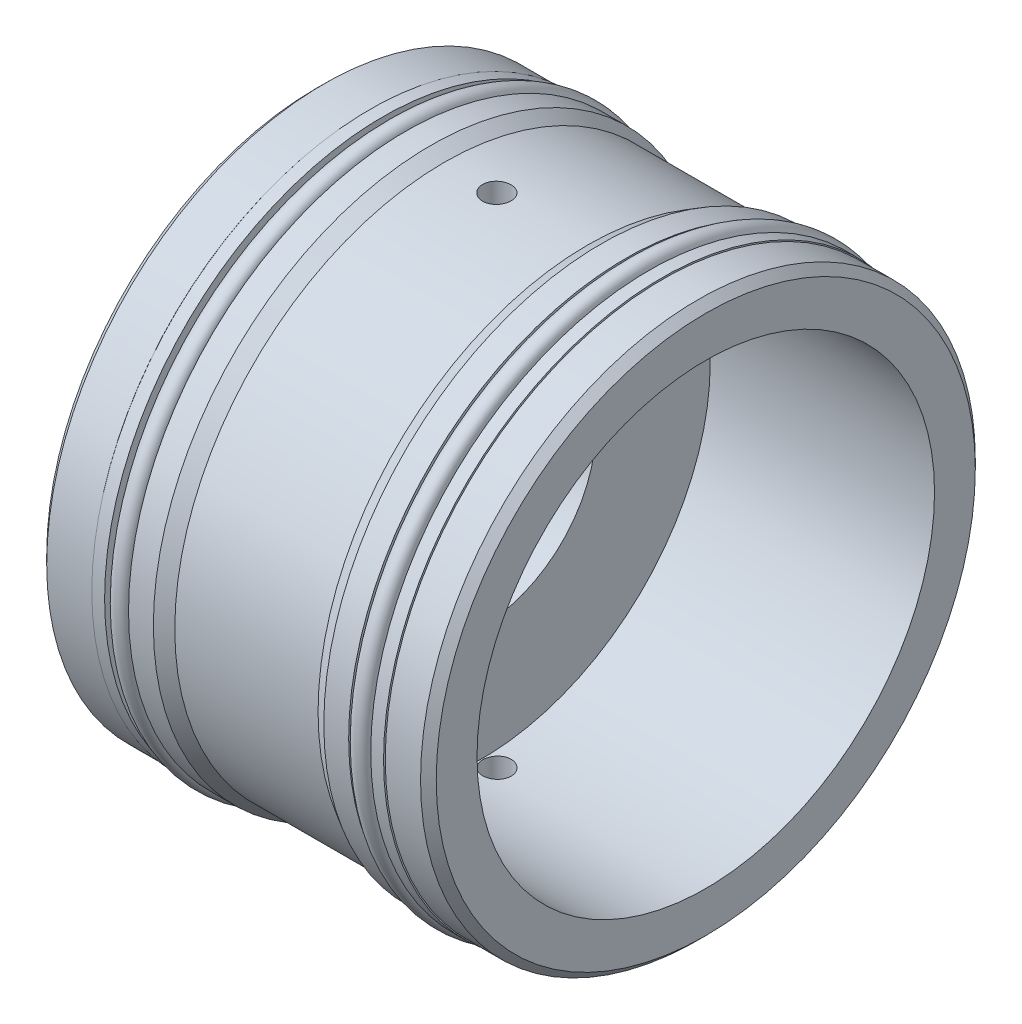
ISO-10303-21;
HEADER;
FILE_DESCRIPTION(('STEP AP214'),'2;1');
FILE_NAME('part.step','',(''),(''),'','','');
FILE_SCHEMA(('AUTOMOTIVE_DESIGN { 1 0 10303 214 1 1 1 1 }'));
ENDSEC;
DATA;
#1=APPLICATION_CONTEXT('core data for automotive mechanical design processes');
#2=APPLICATION_PROTOCOL_DEFINITION('international standard','automotive_design',2000,#1);
#3=PRODUCT_CONTEXT('',#1,'mechanical');
#4=PRODUCT('Part','Part','',(#3));
#5=PRODUCT_RELATED_PRODUCT_CATEGORY('part','',(#4));
#6=PRODUCT_DEFINITION_FORMATION('','',#4);
#7=PRODUCT_DEFINITION_CONTEXT('part definition',#1,'design');
#8=PRODUCT_DEFINITION('design','',#6,#7);
#9=PRODUCT_DEFINITION_SHAPE('','',#8);
#10=(LENGTH_UNIT() NAMED_UNIT(*) SI_UNIT(.MILLI.,.METRE.));
#11=(NAMED_UNIT(*) PLANE_ANGLE_UNIT() SI_UNIT($,.RADIAN.));
#12=(NAMED_UNIT(*) SI_UNIT($,.STERADIAN.) SOLID_ANGLE_UNIT());
#13=UNCERTAINTY_MEASURE_WITH_UNIT(LENGTH_MEASURE(1.E-05),#10,'distance_accuracy_value','');
#14=(GEOMETRIC_REPRESENTATION_CONTEXT(3) GLOBAL_UNCERTAINTY_ASSIGNED_CONTEXT((#13)) GLOBAL_UNIT_ASSIGNED_CONTEXT((#10,
#11,#12)) REPRESENTATION_CONTEXT('',''));
#15=CARTESIAN_POINT('',(0.,0.,0.));
#16=DIRECTION('',(0.,0.,1.));
#17=DIRECTION('',(1.,0.,0.));
#18=AXIS2_PLACEMENT_3D('',#15,#16,#17);
#19=CARTESIAN_POINT('',(0.,0.,0.));
#20=DIRECTION('',(-1.,0.,0.));
#21=DIRECTION('',(0.,0.,1.));
#22=AXIS2_PLACEMENT_3D('',#19,#20,#21);
#23=CYLINDRICAL_SURFACE('',#22,26.1874);
#24=CARTESIAN_POINT('',(-6.47797728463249,0.,0.));
#25=DIRECTION('',(-1.,0.,0.));
#26=DIRECTION('',(0.,0.,1.));
#27=AXIS2_PLACEMENT_3D('',#24,#25,#26);
#28=CIRCLE('',#27,26.1874);
#29=CARTESIAN_POINT('',(-6.47797728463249,0.,26.1874));
#30=VERTEX_POINT('',#29);
#31=EDGE_CURVE('E38',#30,#30,#28,.T.);
#32=ORIENTED_EDGE('',*,*,#31,.F.);
#33=EDGE_LOOP('',(#32));
#34=FACE_BOUND('',#33,.T.);
#35=CARTESIAN_POINT('',(-1.3716,-26.1507864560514,1.3843));
#36=CARTESIAN_POINT('',(-1.29390156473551,-26.150786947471,1.38429657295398));
#37=CARTESIAN_POINT('',(-1.21614817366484,-26.1511364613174,1.37773640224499));
#38=CARTESIAN_POINT('',(-1.06278676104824,-26.1524969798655,1.35165985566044));
#39=CARTESIAN_POINT('',(-0.987181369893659,-26.1535087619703,1.33212825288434));
#40=CARTESIAN_POINT('',(-0.840359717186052,-26.156078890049,1.28067000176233));
#41=CARTESIAN_POINT('',(-0.769141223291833,-26.1576369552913,1.24874971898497));
#42=CARTESIAN_POINT('',(-0.633092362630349,-26.1611237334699,1.17343009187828));
#43=CARTESIAN_POINT('',(-0.568260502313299,-26.1630523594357,1.13003344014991));
#44=CARTESIAN_POINT('',(-0.446733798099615,-26.1670653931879,1.03293928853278));
#45=CARTESIAN_POINT('',(-0.390046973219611,-26.1691499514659,0.979231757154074));
#46=CARTESIAN_POINT('',(-0.286487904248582,-26.1732385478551,0.863060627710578));
#47=CARTESIAN_POINT('',(-0.239616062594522,-26.175242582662,0.800596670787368));
#48=CARTESIAN_POINT('',(-0.156994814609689,-26.1789454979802,0.668643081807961));
#49=CARTESIAN_POINT('',(-0.121251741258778,-26.1806442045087,0.599149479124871));
#50=CARTESIAN_POINT('',(-0.0619432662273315,-26.183543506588,0.455137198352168));
#51=CARTESIAN_POINT('',(-0.0383777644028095,-26.1847441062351,0.380618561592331));
#52=CARTESIAN_POINT('',(-0.00411479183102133,-26.1865108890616,0.228746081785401));
#53=CARTESIAN_POINT('',(0.00659480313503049,-26.1870776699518,0.151394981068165));
#54=CARTESIAN_POINT('',(0.0148793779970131,-26.1875149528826,-0.00400898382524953));
#55=CARTESIAN_POINT('',(0.0124544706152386,-26.1873854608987,-0.0820618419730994));
#56=CARTESIAN_POINT('',(-0.00545107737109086,-26.1864452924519,-0.236571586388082));
#57=CARTESIAN_POINT('',(-0.0209186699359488,-26.1856352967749,-0.313029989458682));
#58=CARTESIAN_POINT('',(-0.0644502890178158,-26.1834261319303,-0.462263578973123));
#59=CARTESIAN_POINT('',(-0.0925143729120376,-26.1820269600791,-0.535038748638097));
#60=CARTESIAN_POINT('',(-0.160457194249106,-26.1787958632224,-0.674882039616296));
#61=CARTESIAN_POINT('',(-0.200341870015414,-26.1769637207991,-0.741947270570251));
#62=CARTESIAN_POINT('',(-0.290789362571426,-26.1730729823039,-0.86843536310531));
#63=CARTESIAN_POINT('',(-0.341352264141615,-26.1710143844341,-0.927858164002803));
#64=CARTESIAN_POINT('',(-0.451794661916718,-26.1668995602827,-1.03745071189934));
#65=CARTESIAN_POINT('',(-0.511685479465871,-26.1648433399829,-1.08760905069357));
#66=CARTESIAN_POINT('',(-0.639043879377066,-26.1609676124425,-1.17716096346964));
#67=CARTESIAN_POINT('',(-0.706511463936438,-26.1591481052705,-1.21655453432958));
#68=CARTESIAN_POINT('',(-0.847115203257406,-26.1559511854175,-1.28345771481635));
#69=CARTESIAN_POINT('',(-0.920251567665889,-26.1545737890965,-1.31096688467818));
#70=CARTESIAN_POINT('',(-1.07011363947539,-26.1524170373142,-1.35331270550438));
#71=CARTESIAN_POINT('',(-1.14683931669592,-26.1516376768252,-1.36814946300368));
#72=CARTESIAN_POINT('',(-1.30160264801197,-26.1507658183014,-1.38471516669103));
#73=CARTESIAN_POINT('',(-1.37963860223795,-26.1506724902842,-1.38645995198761));
#74=CARTESIAN_POINT('',(-1.53489471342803,-26.1511810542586,-1.3768335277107));
#75=CARTESIAN_POINT('',(-1.61211487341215,-26.1517829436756,-1.36546236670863));
#76=CARTESIAN_POINT('',(-1.76350284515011,-26.1536133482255,-1.32993997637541));
#77=CARTESIAN_POINT('',(-1.83767236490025,-26.1548415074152,-1.30579600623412));
#78=CARTESIAN_POINT('',(-1.98090629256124,-26.157785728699,-1.24542070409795));
#79=CARTESIAN_POINT('',(-2.04997066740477,-26.1595017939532,-1.20918929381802));
#80=CARTESIAN_POINT('',(-2.18110666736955,-26.1632304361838,-1.12562697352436));
#81=CARTESIAN_POINT('',(-2.2431715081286,-26.1652432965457,-1.07828542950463));
#82=CARTESIAN_POINT('',(-2.35847838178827,-26.1693376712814,-0.973862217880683));
#83=CARTESIAN_POINT('',(-2.41172035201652,-26.1714191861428,-0.916780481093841));
#84=CARTESIAN_POINT('',(-2.50792342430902,-26.1754186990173,-0.794429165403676));
#85=CARTESIAN_POINT('',(-2.55087429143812,-26.1773365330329,-0.729151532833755));
#86=CARTESIAN_POINT('',(-2.62520595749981,-26.1807902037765,-0.59230208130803));
#87=CARTESIAN_POINT('',(-2.65658681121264,-26.1823260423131,-0.520730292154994));
#88=CARTESIAN_POINT('',(-2.70686978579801,-26.1848418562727,-0.373362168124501));
#89=CARTESIAN_POINT('',(-2.72577843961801,-26.1858221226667,-0.297568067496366));
#90=CARTESIAN_POINT('',(-2.75060165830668,-26.1871174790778,-0.1438756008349));
#91=CARTESIAN_POINT('',(-2.75651630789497,-26.1874325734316,-0.0659772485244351));
#92=CARTESIAN_POINT('',(-2.75518281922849,-26.1873620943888,0.0896109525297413));
#93=CARTESIAN_POINT('',(-2.74795072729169,-26.1869773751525,0.167300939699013));
#94=CARTESIAN_POINT('',(-2.72056224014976,-26.1855522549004,0.320362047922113));
#95=CARTESIAN_POINT('',(-2.70040582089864,-26.1845118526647,0.395733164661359));
#96=CARTESIAN_POINT('',(-2.64774421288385,-26.1818923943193,0.542020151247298));
#97=CARTESIAN_POINT('',(-2.61523896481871,-26.1803133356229,0.612935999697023));
#98=CARTESIAN_POINT('',(-2.53880503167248,-26.176794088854,0.748305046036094));
#99=CARTESIAN_POINT('',(-2.49487668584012,-26.1748539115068,0.812758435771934));
#100=CARTESIAN_POINT('',(-2.39678553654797,-26.1708280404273,0.933453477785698));
#101=CARTESIAN_POINT('',(-2.34261142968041,-26.1687421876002,0.989685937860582));
#102=CARTESIAN_POINT('',(-2.22557622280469,-26.1646611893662,1.09227612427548));
#103=CARTESIAN_POINT('',(-2.16271299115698,-26.1626660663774,1.13863142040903));
#104=CARTESIAN_POINT('',(-2.03002988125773,-26.1589900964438,1.22017578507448));
#105=CARTESIAN_POINT('',(-1.96020298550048,-26.1573095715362,1.25535343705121));
#106=CARTESIAN_POINT('',(-1.81567717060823,-26.1544573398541,1.31344349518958));
#107=CARTESIAN_POINT('',(-1.74098411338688,-26.1532850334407,1.33637036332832));
#108=CARTESIAN_POINT('',(-1.61679037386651,-26.1518912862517,1.3633057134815));
#109=CARTESIAN_POINT('',(-1.56809378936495,-26.1514788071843,1.37116849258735));
#110=CARTESIAN_POINT('',(-1.47013883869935,-26.1509262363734,1.38166672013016));
#111=CARTESIAN_POINT('',(-1.4208804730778,-26.1507861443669,1.38430217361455));
#112=CARTESIAN_POINT('',(-1.3716,-26.1507864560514,1.3843));
#113=B_SPLINE_CURVE_WITH_KNOTS('',3,(#35,#36,#37,#38,#39,#40,#41,#42,#43,#44,#45,#46,#47,#48,
#49,#50,#51,#52,#53,#54,#55,#56,#57,#58,#59,#60,#61,#62,#63,#64,#65,#66,#67,#68,#69,#70,#71,#72,
#73,#74,#75,#76,#77,#78,#79,#80,#81,#82,#83,#84,#85,#86,#87,#88,#89,#90,#91,#92,#93,#94,#95,#96,
#97,#98,#99,#100,#101,#102,#103,#104,#105,#106,#107,#108,#109,#110,#111,#112),.UNSPECIFIED.,.T.,
.F.,(4,2,2,2,2,2,2,2,2,2,2,2,2,2,2,2,2,2,2,2,2,2,2,2,2,2,2,2,2,2,2,2,2,2,2,2,2,2,4),(0.,
0.232915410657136,0.466104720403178,0.699174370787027,0.932189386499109,1.16543226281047,
1.39868470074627,1.63206963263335,1.8654526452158,2.09861538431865,2.33177612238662,
2.5647038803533,2.79763269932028,3.03067873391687,3.26372661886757,3.49705959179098,
3.73039263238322,3.9637343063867,4.19707401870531,4.43013138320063,4.66318788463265,
4.89611207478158,5.12903777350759,5.36218733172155,5.5953385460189,5.82872068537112,
6.06210171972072,6.29536041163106,6.52861758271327,6.76159024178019,6.99456333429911,
7.22753754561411,7.46050483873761,7.69373066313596,7.92701380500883,8.16053445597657,
8.39377882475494,8.54150628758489,8.68923360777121),.UNSPECIFIED.);
#114=CARTESIAN_POINT('',(-1.3716,-26.1507864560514,1.3843));
#115=VERTEX_POINT('',#114);
#116=EDGE_CURVE('E49',#115,#115,#113,.T.);
#117=ORIENTED_EDGE('',*,*,#116,.T.);
#118=EDGE_LOOP('',(#117));
#119=FACE_BOUND('',#118,.T.);
#120=CARTESIAN_POINT('',(-1.3716,26.1507864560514,1.3843));
#121=CARTESIAN_POINT('',(-1.44929843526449,26.150786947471,1.38429657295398));
#122=CARTESIAN_POINT('',(-1.52705182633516,26.1511364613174,1.37773640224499));
#123=CARTESIAN_POINT('',(-1.68041323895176,26.1524969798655,1.35165985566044));
#124=CARTESIAN_POINT('',(-1.75601863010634,26.1535087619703,1.33212825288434));
#125=CARTESIAN_POINT('',(-1.90284028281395,26.156078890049,1.28067000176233));
#126=CARTESIAN_POINT('',(-1.97405877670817,26.1576369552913,1.24874971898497));
#127=CARTESIAN_POINT('',(-2.11010763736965,26.1611237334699,1.17343009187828));
#128=CARTESIAN_POINT('',(-2.1749394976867,26.1630523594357,1.13003344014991));
#129=CARTESIAN_POINT('',(-2.29646620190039,26.1670653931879,1.03293928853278));
#130=CARTESIAN_POINT('',(-2.35315302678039,26.1691499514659,0.979231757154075));
#131=CARTESIAN_POINT('',(-2.45671209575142,26.1732385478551,0.863060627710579));
#132=CARTESIAN_POINT('',(-2.50358393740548,26.175242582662,0.800596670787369));
#133=CARTESIAN_POINT('',(-2.58620518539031,26.1789454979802,0.668643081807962));
#134=CARTESIAN_POINT('',(-2.62194825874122,26.1806442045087,0.599149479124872));
#135=CARTESIAN_POINT('',(-2.68125673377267,26.183543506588,0.455137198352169));
#136=CARTESIAN_POINT('',(-2.70482223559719,26.1847441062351,0.380618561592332));
#137=CARTESIAN_POINT('',(-2.73908520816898,26.1865108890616,0.228746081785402));
#138=CARTESIAN_POINT('',(-2.74979480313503,26.1870776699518,0.151394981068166));
#139=CARTESIAN_POINT('',(-2.75807937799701,26.1875149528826,-0.00400898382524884));
#140=CARTESIAN_POINT('',(-2.75565447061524,26.1873854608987,-0.0820618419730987));
#141=CARTESIAN_POINT('',(-2.73774892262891,26.1864452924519,-0.236571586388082));
#142=CARTESIAN_POINT('',(-2.72228133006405,26.1856352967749,-0.313029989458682));
#143=CARTESIAN_POINT('',(-2.67874971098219,26.1834261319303,-0.462263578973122));
#144=CARTESIAN_POINT('',(-2.65068562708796,26.1820269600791,-0.535038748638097));
#145=CARTESIAN_POINT('',(-2.5827428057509,26.1787958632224,-0.674882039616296));
#146=CARTESIAN_POINT('',(-2.54285812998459,26.1769637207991,-0.741947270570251));
#147=CARTESIAN_POINT('',(-2.45241063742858,26.1730729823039,-0.86843536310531));
#148=CARTESIAN_POINT('',(-2.40184773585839,26.1710143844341,-0.927858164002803));
#149=CARTESIAN_POINT('',(-2.29140533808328,26.1668995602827,-1.03745071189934));
#150=CARTESIAN_POINT('',(-2.23151452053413,26.1648433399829,-1.08760905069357));
#151=CARTESIAN_POINT('',(-2.10415612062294,26.1609676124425,-1.17716096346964));
#152=CARTESIAN_POINT('',(-2.03668853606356,26.1591481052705,-1.21655453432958));
#153=CARTESIAN_POINT('',(-1.8960847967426,26.1559511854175,-1.28345771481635));
#154=CARTESIAN_POINT('',(-1.82294843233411,26.1545737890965,-1.31096688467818));
#155=CARTESIAN_POINT('',(-1.67308636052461,26.1524170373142,-1.35331270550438));
#156=CARTESIAN_POINT('',(-1.59636068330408,26.1516376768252,-1.36814946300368));
#157=CARTESIAN_POINT('',(-1.44159735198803,26.1507658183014,-1.38471516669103));
#158=CARTESIAN_POINT('',(-1.36356139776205,26.1506724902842,-1.38645995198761));
#159=CARTESIAN_POINT('',(-1.20830528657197,26.1511810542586,-1.3768335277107));
#160=CARTESIAN_POINT('',(-1.13108512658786,26.1517829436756,-1.36546236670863));
#161=CARTESIAN_POINT('',(-0.979697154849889,26.1536133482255,-1.32993997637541));
#162=CARTESIAN_POINT('',(-0.905527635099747,26.1548415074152,-1.30579600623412));
#163=CARTESIAN_POINT('',(-0.762293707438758,26.157785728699,-1.24542070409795));
#164=CARTESIAN_POINT('',(-0.693229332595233,26.1595017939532,-1.20918929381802));
#165=CARTESIAN_POINT('',(-0.56209333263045,26.1632304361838,-1.12562697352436));
#166=CARTESIAN_POINT('',(-0.500028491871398,26.1652432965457,-1.07828542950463));
#167=CARTESIAN_POINT('',(-0.384721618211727,26.1693376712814,-0.973862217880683));
#168=CARTESIAN_POINT('',(-0.331479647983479,26.1714191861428,-0.916780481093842));
#169=CARTESIAN_POINT('',(-0.235276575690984,26.1754186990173,-0.794429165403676));
#170=CARTESIAN_POINT('',(-0.192325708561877,26.1773365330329,-0.729151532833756));
#171=CARTESIAN_POINT('',(-0.11799404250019,26.1807902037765,-0.592302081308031));
#172=CARTESIAN_POINT('',(-0.086613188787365,26.1823260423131,-0.520730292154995));
#173=CARTESIAN_POINT('',(-0.036330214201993,26.1848418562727,-0.373362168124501));
#174=CARTESIAN_POINT('',(-0.0174215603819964,26.1858221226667,-0.297568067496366));
#175=CARTESIAN_POINT('',(0.00740165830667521,26.1871174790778,-0.143875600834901));
#176=CARTESIAN_POINT('',(0.0133163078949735,26.1874325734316,-0.0659772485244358));
#177=CARTESIAN_POINT('',(0.0119828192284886,26.1873620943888,0.0896109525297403));
#178=CARTESIAN_POINT('',(0.00475072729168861,26.1869773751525,0.167300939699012));
#179=CARTESIAN_POINT('',(-0.022637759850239,26.1855522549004,0.320362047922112));
#180=CARTESIAN_POINT('',(-0.042794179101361,26.1845118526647,0.395733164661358));
#181=CARTESIAN_POINT('',(-0.0954557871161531,26.1818923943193,0.542020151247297));
#182=CARTESIAN_POINT('',(-0.127961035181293,26.1803133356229,0.612935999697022));
#183=CARTESIAN_POINT('',(-0.204394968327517,26.176794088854,0.748305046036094));
#184=CARTESIAN_POINT('',(-0.248323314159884,26.1748539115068,0.812758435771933));
#185=CARTESIAN_POINT('',(-0.346414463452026,26.1708280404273,0.933453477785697));
#186=CARTESIAN_POINT('',(-0.400588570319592,26.1687421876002,0.989685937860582));
#187=CARTESIAN_POINT('',(-0.517623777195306,26.1646611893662,1.09227612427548));
#188=CARTESIAN_POINT('',(-0.580487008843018,26.1626660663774,1.13863142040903));
#189=CARTESIAN_POINT('',(-0.713170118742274,26.1589900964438,1.22017578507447));
#190=CARTESIAN_POINT('',(-0.782997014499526,26.1573095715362,1.25535343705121));
#191=CARTESIAN_POINT('',(-0.927522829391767,26.1544573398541,1.31344349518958));
#192=CARTESIAN_POINT('',(-1.00221588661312,26.1532850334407,1.33637036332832));
#193=CARTESIAN_POINT('',(-1.12640962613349,26.1518912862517,1.3633057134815));
#194=CARTESIAN_POINT('',(-1.17510621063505,26.1514788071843,1.37116849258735));
#195=CARTESIAN_POINT('',(-1.27306116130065,26.1509262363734,1.38166672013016));
#196=CARTESIAN_POINT('',(-1.3223195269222,26.1507861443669,1.38430217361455));
#197=CARTESIAN_POINT('',(-1.3716,26.1507864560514,1.3843));
#198=B_SPLINE_CURVE_WITH_KNOTS('',3,(#120,#121,#122,#123,#124,#125,#126,#127,#128,#129,#130,
#131,#132,#133,#134,#135,#136,#137,#138,#139,#140,#141,#142,#143,#144,#145,#146,#147,#148,#149,
#150,#151,#152,#153,#154,#155,#156,#157,#158,#159,#160,#161,#162,#163,#164,#165,#166,#167,#168,
#169,#170,#171,#172,#173,#174,#175,#176,#177,#178,#179,#180,#181,#182,#183,#184,#185,#186,#187,
#188,#189,#190,#191,#192,#193,#194,#195,#196,#197),.UNSPECIFIED.,.T.,.F.,(4,2,2,2,2,2,2,2,2,2,2,
2,2,2,2,2,2,2,2,2,2,2,2,2,2,2,2,2,2,2,2,2,2,2,2,2,2,2,4),(0.,0.232915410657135,
0.466104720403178,0.699174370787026,0.932189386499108,1.16543226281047,1.39868470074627,
1.63206963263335,1.8654526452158,2.09861538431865,2.33177612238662,2.56470388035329,
2.79763269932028,3.03067873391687,3.26372661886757,3.49705959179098,3.73039263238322,
3.9637343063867,4.1970740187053,4.43013138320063,4.66318788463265,4.89611207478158,
5.12903777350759,5.36218733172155,5.5953385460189,5.82872068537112,6.06210171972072,
6.29536041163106,6.52861758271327,6.76159024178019,6.9945633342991,7.2275375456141,
7.46050483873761,7.69373066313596,7.92701380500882,8.16053445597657,8.39377882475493,
8.54150628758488,8.68923360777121),.UNSPECIFIED.);
#199=CARTESIAN_POINT('',(-1.3716,26.1507864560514,1.3843));
#200=VERTEX_POINT('',#199);
#201=EDGE_CURVE('E57',#200,#200,#198,.T.);
#202=ORIENTED_EDGE('',*,*,#201,.T.);
#203=EDGE_LOOP('',(#202));
#204=FACE_BOUND('',#203,.T.);
#205=CARTESIAN_POINT('',(7.44317728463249,0.,0.));
#206=DIRECTION('',(1.,0.,0.));
#207=DIRECTION('',(0.,0.,-1.));
#208=AXIS2_PLACEMENT_3D('',#205,#206,#207);
#209=CIRCLE('',#208,26.1874);
#210=CARTESIAN_POINT('',(7.44317728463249,0.,-26.1874));
#211=VERTEX_POINT('',#210);
#212=EDGE_CURVE('E10',#211,#211,#209,.T.);
#213=ORIENTED_EDGE('',*,*,#212,.F.);
#214=EDGE_LOOP('',(#213));
#215=FACE_BOUND('',#214,.T.);
#216=ADVANCED_FACE('F31',(#34,#119,#204,#215),#23,.T.);
#217=CARTESIAN_POINT('',(0.,0.,0.));
#218=DIRECTION('',(-1.,0.,0.));
#219=DIRECTION('',(0.,0.,1.));
#220=AXIS2_PLACEMENT_3D('',#217,#218,#219);
#221=CYLINDRICAL_SURFACE('',#220,25.6921);
#222=CARTESIAN_POINT('',(12.5013071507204,0.,0.));
#223=DIRECTION('',(-1.,0.,0.));
#224=DIRECTION('',(0.,0.,1.));
#225=AXIS2_PLACEMENT_3D('',#222,#223,#224);
#226=CIRCLE('',#225,25.6921);
#227=CARTESIAN_POINT('',(12.5013071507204,0.,25.6921));
#228=VERTEX_POINT('',#227);
#229=EDGE_CURVE('E207',#228,#228,#226,.T.);
#230=ORIENTED_EDGE('',*,*,#229,.F.);
#231=EDGE_LOOP('',(#230));
#232=FACE_BOUND('',#231,.T.);
#233=CARTESIAN_POINT('',(13.4112,0.,0.));
#234=DIRECTION('',(1.,0.,0.));
#235=DIRECTION('',(0.,0.,-1.));
#236=AXIS2_PLACEMENT_3D('',#233,#234,#235);
#237=CIRCLE('',#236,25.6921);
#238=CARTESIAN_POINT('',(13.4112,0.,-25.6921));
#239=VERTEX_POINT('',#238);
#240=EDGE_CURVE('E42',#239,#239,#237,.T.);
#241=ORIENTED_EDGE('',*,*,#240,.F.);
#242=EDGE_LOOP('',(#241));
#243=FACE_BOUND('',#242,.T.);
#244=ADVANCED_FACE('F122',(#232,#243),#221,.T.);
#245=CARTESIAN_POINT('',(14.732,0.,0.));
#246=DIRECTION('',(-1.,0.,0.));
#247=DIRECTION('',(0.,0.,1.));
#248=AXIS2_PLACEMENT_3D('',#245,#246,#247);
#249=CIRCLE('',#248,25.6921);
#250=CARTESIAN_POINT('',(14.732,0.,25.6921));
#251=VERTEX_POINT('',#250);
#252=EDGE_CURVE('E168',#251,#251,#249,.T.);
#253=ORIENTED_EDGE('',*,*,#252,.T.);
#254=EDGE_LOOP('',(#253));
#255=FACE_BOUND('',#254,.T.);
#256=CARTESIAN_POINT('',(14.6558,0.,0.));
#257=DIRECTION('',(-1.,0.,0.));
#258=DIRECTION('',(0.,0.,1.));
#259=AXIS2_PLACEMENT_3D('',#256,#257,#258);
#260=CIRCLE('',#259,25.6921);
#261=CARTESIAN_POINT('',(14.6558,0.,25.6921));
#262=VERTEX_POINT('',#261);
#263=EDGE_CURVE('E46',#262,#262,#260,.T.);
#264=ORIENTED_EDGE('',*,*,#263,.F.);
#265=EDGE_LOOP('',(#264));
#266=FACE_BOUND('',#265,.T.);
#267=ADVANCED_FACE('F127',(#255,#266),#221,.T.);
#268=CARTESIAN_POINT('',(11.176,0.,0.));
#269=DIRECTION('',(-1.,0.,0.));
#270=DIRECTION('',(0.,0.,1.));
#271=AXIS2_PLACEMENT_3D('',#268,#269,#270);
#272=CIRCLE('',#271,25.6921);
#273=CARTESIAN_POINT('',(11.176,0.,25.6921));
#274=VERTEX_POINT('',#273);
#275=EDGE_CURVE('E159',#274,#274,#272,.T.);
#276=ORIENTED_EDGE('',*,*,#275,.F.);
#277=EDGE_LOOP('',(#276));
#278=FACE_BOUND('',#277,.T.);
#279=CARTESIAN_POINT('',(11.7810928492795,0.,0.));
#280=DIRECTION('',(1.,0.,0.));
#281=DIRECTION('',(0.,0.,-1.));
#282=AXIS2_PLACEMENT_3D('',#279,#280,#281);
#283=CIRCLE('',#282,25.6921);
#284=CARTESIAN_POINT('',(11.7810928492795,0.,-25.6921));
#285=VERTEX_POINT('',#284);
#286=EDGE_CURVE('E210',#285,#285,#283,.T.);
#287=ORIENTED_EDGE('',*,*,#286,.F.);
#288=EDGE_LOOP('',(#287));
#289=FACE_BOUND('',#288,.T.);
#290=ADVANCED_FACE('F130',(#278,#289),#221,.T.);
#291=CARTESIAN_POINT('',(0.,0.,0.));
#292=DIRECTION('',(-1.,0.,0.));
#293=DIRECTION('',(0.,0.,1.));
#294=AXIS2_PLACEMENT_3D('',#291,#292,#293);
#295=CYLINDRICAL_SURFACE('',#294,25.6921);
#296=CARTESIAN_POINT('',(-12.446,0.,0.));
#297=DIRECTION('',(-1.,0.,0.));
#298=DIRECTION('',(0.,0.,1.));
#299=AXIS2_PLACEMENT_3D('',#296,#297,#298);
#300=CIRCLE('',#299,25.6921);
#301=CARTESIAN_POINT('',(-12.446,0.,25.6921));
#302=VERTEX_POINT('',#301);
#303=EDGE_CURVE('E195',#302,#302,#300,.T.);
#304=ORIENTED_EDGE('',*,*,#303,.F.);
#305=EDGE_LOOP('',(#304));
#306=FACE_BOUND('',#305,.T.);
#307=CARTESIAN_POINT('',(-11.5361071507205,0.,0.));
#308=DIRECTION('',(1.,0.,0.));
#309=DIRECTION('',(0.,0.,-1.));
#310=AXIS2_PLACEMENT_3D('',#307,#308,#309);
#311=CIRCLE('',#310,25.6921);
#312=CARTESIAN_POINT('',(-11.5361071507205,0.,-25.6921));
#313=VERTEX_POINT('',#312);
#314=EDGE_CURVE('E204',#313,#313,#311,.T.);
#315=ORIENTED_EDGE('',*,*,#314,.F.);
#316=EDGE_LOOP('',(#315));
#317=FACE_BOUND('',#316,.T.);
#318=ADVANCED_FACE('F222',(#306,#317),#295,.T.);
#319=CARTESIAN_POINT('',(-10.2108,0.,0.));
#320=DIRECTION('',(-1.,0.,0.));
#321=DIRECTION('',(0.,0.,1.));
#322=AXIS2_PLACEMENT_3D('',#319,#320,#321);
#323=CIRCLE('',#322,25.6921);
#324=CARTESIAN_POINT('',(-10.2108,0.,25.6921));
#325=VERTEX_POINT('',#324);
#326=EDGE_CURVE('E162',#325,#325,#323,.T.);
#327=ORIENTED_EDGE('',*,*,#326,.T.);
#328=EDGE_LOOP('',(#327));
#329=FACE_BOUND('',#328,.T.);
#330=CARTESIAN_POINT('',(-10.8158928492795,0.,0.));
#331=DIRECTION('',(-1.,0.,0.));
#332=DIRECTION('',(0.,0.,1.));
#333=AXIS2_PLACEMENT_3D('',#330,#331,#332);
#334=CIRCLE('',#333,25.6921);
#335=CARTESIAN_POINT('',(-10.8158928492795,0.,25.6921));
#336=VERTEX_POINT('',#335);
#337=EDGE_CURVE('E201',#336,#336,#334,.T.);
#338=ORIENTED_EDGE('',*,*,#337,.F.);
#339=EDGE_LOOP('',(#338));
#340=FACE_BOUND('',#339,.T.);
#341=ADVANCED_FACE('F270',(#329,#340),#295,.T.);
#342=CARTESIAN_POINT('',(-13.7668,0.,0.));
#343=DIRECTION('',(-1.,0.,0.));
#344=DIRECTION('',(0.,0.,1.));
#345=AXIS2_PLACEMENT_3D('',#342,#343,#344);
#346=CIRCLE('',#345,25.6921);
#347=CARTESIAN_POINT('',(-13.7668,0.,25.6921));
#348=VERTEX_POINT('',#347);
#349=EDGE_CURVE('E259',#348,#348,#346,.T.);
#350=ORIENTED_EDGE('',*,*,#349,.F.);
#351=EDGE_LOOP('',(#350));
#352=FACE_BOUND('',#351,.T.);
#353=CARTESIAN_POINT('',(-13.6906,0.,0.));
#354=DIRECTION('',(1.,0.,0.));
#355=DIRECTION('',(0.,0.,-1.));
#356=AXIS2_PLACEMENT_3D('',#353,#354,#355);
#357=CIRCLE('',#356,25.6921);
#358=CARTESIAN_POINT('',(-13.6906,0.,-25.6921));
#359=VERTEX_POINT('',#358);
#360=EDGE_CURVE('E198',#359,#359,#357,.T.);
#361=ORIENTED_EDGE('',*,*,#360,.F.);
#362=EDGE_LOOP('',(#361));
#363=FACE_BOUND('',#362,.T.);
#364=ADVANCED_FACE('F104',(#352,#363),#295,.T.);
#365=CARTESIAN_POINT('',(0.,0.,0.));
#366=DIRECTION('',(-1.,0.,0.));
#367=DIRECTION('',(0.,0.,1.));
#368=AXIS2_PLACEMENT_3D('',#365,#366,#367);
#369=CYLINDRICAL_SURFACE('',#368,11.1125);
#370=CARTESIAN_POINT('',(-2.8702,0.,0.));
#371=DIRECTION('',(-1.,0.,0.));
#372=DIRECTION('',(0.,0.,1.));
#373=AXIS2_PLACEMENT_3D('',#370,#371,#372);
#374=CIRCLE('',#373,11.1125);
#375=CARTESIAN_POINT('',(-2.8702,0.,11.1125));
#376=VERTEX_POINT('',#375);
#377=EDGE_CURVE('E180',#376,#376,#374,.T.);
#378=ORIENTED_EDGE('',*,*,#377,.F.);
#379=EDGE_LOOP('',(#378));
#380=FACE_BOUND('',#379,.T.);
#381=CARTESIAN_POINT('',(-18.923,0.,0.));
#382=DIRECTION('',(-1.,0.,0.));
#383=DIRECTION('',(0.,0.,1.));
#384=AXIS2_PLACEMENT_3D('',#381,#382,#383);
#385=CIRCLE('',#384,11.1125);
#386=CARTESIAN_POINT('',(-18.923,0.,11.1125));
#387=VERTEX_POINT('',#386);
#388=EDGE_CURVE('E253',#387,#387,#385,.T.);
#389=ORIENTED_EDGE('',*,*,#388,.T.);
#390=EDGE_LOOP('',(#389));
#391=FACE_BOUND('',#390,.T.);
#392=ADVANCED_FACE('F101',(#380,#391),#369,.F.);
#393=CARTESIAN_POINT('',(-2.8702,11.1125,0.));
#394=DIRECTION('',(-1.,0.,0.));
#395=DIRECTION('',(0.,0.,1.));
#396=AXIS2_PLACEMENT_3D('',#393,#394,#395);
#397=PLANE('',#396);
#398=CARTESIAN_POINT('',(-2.8702,0.,0.));
#399=DIRECTION('',(-1.,0.,0.));
#400=DIRECTION('',(0.,0.,1.));
#401=AXIS2_PLACEMENT_3D('',#398,#399,#400);
#402=CIRCLE('',#401,22.225);
#403=CARTESIAN_POINT('',(-2.8702,0.,22.225));
#404=VERTEX_POINT('',#403);
#405=EDGE_CURVE('E177',#404,#404,#402,.T.);
#406=ORIENTED_EDGE('',*,*,#405,.F.);
#407=EDGE_LOOP('',(#406));
#408=FACE_BOUND('',#407,.T.);
#409=ORIENTED_EDGE('',*,*,#377,.T.);
#410=EDGE_LOOP('',(#409));
#411=FACE_BOUND('',#410,.T.);
#412=ADVANCED_FACE('F95',(#408,#411),#397,.F.);
#413=CARTESIAN_POINT('',(0.,0.,0.));
#414=DIRECTION('',(-1.,0.,0.));
#415=DIRECTION('',(0.,0.,1.));
#416=AXIS2_PLACEMENT_3D('',#413,#414,#415);
#417=CYLINDRICAL_SURFACE('',#416,22.225);
#418=CARTESIAN_POINT('',(-1.3716,-22.1818470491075,1.3843));
#419=CARTESIAN_POINT('',(-1.44927578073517,-22.1818476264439,1.38429658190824));
#420=CARTESIAN_POINT('',(-1.52700596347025,-22.1822594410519,1.37774022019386));
#421=CARTESIAN_POINT('',(-1.68032004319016,-22.1838623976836,1.35167968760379));
#422=CARTESIAN_POINT('',(-1.75590133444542,-22.1850544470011,1.33216044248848));
#423=CARTESIAN_POINT('',(-1.90267466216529,-22.1880823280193,1.28073694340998));
#424=CARTESIAN_POINT('',(-1.97386899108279,-22.1899178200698,1.24883922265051));
#425=CARTESIAN_POINT('',(-2.1098742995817,-22.1940253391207,1.17357478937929));
#426=CARTESIAN_POINT('',(-2.17468673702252,-22.1962972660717,1.13021070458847));
#427=CARTESIAN_POINT('',(-2.29620391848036,-22.2010255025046,1.03317344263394));
#428=CARTESIAN_POINT('',(-2.35289787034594,-22.2034820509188,0.979486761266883));
#429=CARTESIAN_POINT('',(-2.45647639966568,-22.208300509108,0.863356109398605));
#430=CARTESIAN_POINT('',(-2.50336056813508,-22.210662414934,0.800911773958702));
#431=CARTESIAN_POINT('',(-2.58602153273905,-22.2150275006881,0.668977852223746));
#432=CARTESIAN_POINT('',(-2.62178944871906,-22.2170303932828,0.599482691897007));
#433=CARTESIAN_POINT('',(-2.68114571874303,-22.2204492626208,0.455458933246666));
#434=CARTESIAN_POINT('',(-2.70473420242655,-22.2218652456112,0.380930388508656));
#435=CARTESIAN_POINT('',(-2.73903220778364,-22.2239491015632,0.229058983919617));
#436=CARTESIAN_POINT('',(-2.74975856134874,-22.2246179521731,0.151719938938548));
#437=CARTESIAN_POINT('',(-2.75807980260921,-22.2251354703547,-0.00366361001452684));
#438=CARTESIAN_POINT('',(-2.7556748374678,-22.2249841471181,-0.081708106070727));
#439=CARTESIAN_POINT('',(-2.73781559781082,-22.2238791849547,-0.236173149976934));
#440=CARTESIAN_POINT('',(-2.72237943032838,-22.222926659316,-0.312595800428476));
#441=CARTESIAN_POINT('',(-2.67892406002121,-22.2203278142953,-0.461763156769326));
#442=CARTESIAN_POINT('',(-2.65090478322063,-22.2186814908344,-0.534507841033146));
#443=CARTESIAN_POINT('',(-2.58305805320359,-22.2148785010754,-0.674312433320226));
#444=CARTESIAN_POINT('',(-2.5432223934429,-22.2127214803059,-0.741368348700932));
#445=CARTESIAN_POINT('',(-2.45287965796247,-22.2081398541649,-0.867848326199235));
#446=CARTESIAN_POINT('',(-2.40237246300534,-22.2057152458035,-0.927272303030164));
#447=CARTESIAN_POINT('',(-2.29201810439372,-22.2008664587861,-1.03690725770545));
#448=CARTESIAN_POINT('',(-2.23215522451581,-22.1984422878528,-1.08710241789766));
#449=CARTESIAN_POINT('',(-2.10484384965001,-22.1938717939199,-1.17673292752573));
#450=CARTESIAN_POINT('',(-2.03739535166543,-22.1917254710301,-1.21616827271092));
#451=CARTESIAN_POINT('',(-1.89681731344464,-22.1879530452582,-1.28315859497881));
#452=CARTESIAN_POINT('',(-1.82368745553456,-22.1863269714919,-1.31071290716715));
#453=CARTESIAN_POINT('',(-1.67382719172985,-22.1837794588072,-1.35314808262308));
#454=CARTESIAN_POINT('',(-1.59709682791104,-22.1828580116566,-1.36802909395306));
#455=CARTESIAN_POINT('',(-1.44235161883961,-22.1818252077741,-1.38467554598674));
#456=CARTESIAN_POINT('',(-1.36433914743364,-22.1817124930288,-1.38646297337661));
#457=CARTESIAN_POINT('',(-1.20912293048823,-22.1823063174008,-1.37692896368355));
#458=CARTESIAN_POINT('',(-1.131919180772,-22.1830128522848,-1.36560759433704));
#459=CARTESIAN_POINT('',(-0.980574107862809,-22.1851643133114,-1.33019562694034));
#460=CARTESIAN_POINT('',(-0.906430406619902,-22.1866086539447,-1.30611515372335));
#461=CARTESIAN_POINT('',(-0.763236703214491,-22.1900724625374,-1.2458787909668));
#462=CARTESIAN_POINT('',(-0.694186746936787,-22.192091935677,-1.20972279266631));
#463=CARTESIAN_POINT('',(-0.563039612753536,-22.1964817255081,-1.12630552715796));
#464=CARTESIAN_POINT('',(-0.500951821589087,-22.1988525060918,-1.07902952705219));
#465=CARTESIAN_POINT('',(-0.385586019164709,-22.203676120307,-0.974735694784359));
#466=CARTESIAN_POINT('',(-0.332308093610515,-22.2061289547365,-0.917717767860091));
#467=CARTESIAN_POINT('',(-0.236000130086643,-22.2108442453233,-0.79546398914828));
#468=CARTESIAN_POINT('',(-0.192984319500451,-22.2131064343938,-0.730216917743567));
#469=CARTESIAN_POINT('',(-0.118519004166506,-22.2171816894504,-0.593413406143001));
#470=CARTESIAN_POINT('',(-0.0870694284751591,-22.2189947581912,-0.521857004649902));
#471=CARTESIAN_POINT('',(-0.0366540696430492,-22.2219662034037,-0.374518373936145));
#472=CARTESIAN_POINT('',(-0.0176792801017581,-22.2231250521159,-0.29873923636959));
#473=CARTESIAN_POINT('',(0.00727735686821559,-22.2246593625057,-0.145063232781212));
#474=CARTESIAN_POINT('',(0.0132593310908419,-22.2250348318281,-0.067166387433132));
#475=CARTESIAN_POINT('',(0.0120592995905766,-22.2249601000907,0.0883929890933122));
#476=CARTESIAN_POINT('',(0.00489956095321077,-22.224511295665,0.166055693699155));
#477=CARTESIAN_POINT('',(-0.0223344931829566,-22.2228412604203,0.319073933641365));
#478=CARTESIAN_POINT('',(-0.0424088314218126,-22.2216200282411,0.394429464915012));
#479=CARTESIAN_POINT('',(-0.0948972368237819,-22.2185424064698,0.540697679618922));
#480=CARTESIAN_POINT('',(-0.127311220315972,-22.2166860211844,0.611610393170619));
#481=CARTESIAN_POINT('',(-0.203555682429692,-22.212546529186,0.746989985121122));
#482=CARTESIAN_POINT('',(-0.247385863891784,-22.2102634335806,0.811457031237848));
#483=CARTESIAN_POINT('',(-0.345300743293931,-22.2055227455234,0.932228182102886));
#484=CARTESIAN_POINT('',(-0.399401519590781,-22.2030648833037,0.988519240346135));
#485=CARTESIAN_POINT('',(-0.516300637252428,-22.1982538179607,1.09123978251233));
#486=CARTESIAN_POINT('',(-0.579101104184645,-22.1959006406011,1.13766684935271));
#487=CARTESIAN_POINT('',(-0.711688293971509,-22.1915621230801,1.21937566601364));
#488=CARTESIAN_POINT('',(-0.78148355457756,-22.1895772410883,1.25464357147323));
#489=CARTESIAN_POINT('',(-0.925966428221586,-22.186205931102,1.31291711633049));
#490=CARTESIAN_POINT('',(-1.00064819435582,-22.1848188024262,1.33593712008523));
#491=CARTESIAN_POINT('',(-1.12508916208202,-22.183163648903,1.36307724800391));
#492=CARTESIAN_POINT('',(-1.17404394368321,-22.182672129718,1.37102549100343));
#493=CARTESIAN_POINT('',(-1.27252510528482,-22.1820136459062,1.38163795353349));
#494=CARTESIAN_POINT('',(-1.32205148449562,-22.1818466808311,1.38430218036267));
#495=CARTESIAN_POINT('',(-1.3716,-22.1818470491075,1.3843));
#496=B_SPLINE_CURVE_WITH_KNOTS('',3,(#418,#419,#420,#421,#422,#423,#424,#425,#426,#427,#428,
#429,#430,#431,#432,#433,#434,#435,#436,#437,#438,#439,#440,#441,#442,#443,#444,#445,#446,#447,
#448,#449,#450,#451,#452,#453,#454,#455,#456,#457,#458,#459,#460,#461,#462,#463,#464,#465,#466,
#467,#468,#469,#470,#471,#472,#473,#474,#475,#476,#477,#478,#479,#480,#481,#482,#483,#484,#485,
#486,#487,#488,#489,#490,#491,#492,#493,#494,#495),.UNSPECIFIED.,.T.,.F.,(4,2,2,2,2,2,2,2,2,2,2,
2,2,2,2,2,2,2,2,2,2,2,2,2,2,2,2,2,2,2,2,2,2,2,2,2,2,2,4),(0.,0.232846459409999,
0.465964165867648,0.698959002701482,0.931900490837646,1.16514881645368,1.39840686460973,
1.63185077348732,1.86529219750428,2.09842779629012,2.3315607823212,2.56437035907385,
2.79718130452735,3.03015431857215,3.26312993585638,3.49650121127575,3.7298725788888,
3.9632570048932,4.19663870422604,4.42962842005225,4.66261693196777,4.89542083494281,
5.12822683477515,5.36134303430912,5.59446150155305,5.82790130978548,6.06133968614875,
6.29460934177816,6.52787672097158,6.76074922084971,6.99362213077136,7.22649346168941,
7.45935873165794,7.6925915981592,7.92588155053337,8.15945980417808,8.39276350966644,
8.54129387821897,8.68982404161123),.UNSPECIFIED.);
#497=CARTESIAN_POINT('',(-1.3716,-22.1818470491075,1.3843));
#498=VERTEX_POINT('',#497);
#499=EDGE_CURVE('E84',#498,#498,#496,.T.);
#500=ORIENTED_EDGE('',*,*,#499,.T.);
#501=EDGE_LOOP('',(#500));
#502=FACE_BOUND('',#501,.T.);
#503=CARTESIAN_POINT('',(-1.3716,22.1818470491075,1.3843));
#504=CARTESIAN_POINT('',(-1.29392421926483,22.1818476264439,1.38429658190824));
#505=CARTESIAN_POINT('',(-1.21619403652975,22.1822594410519,1.37774022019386));
#506=CARTESIAN_POINT('',(-1.06287995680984,22.1838623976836,1.35167968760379));
#507=CARTESIAN_POINT('',(-0.987298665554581,22.1850544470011,1.33216044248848));
#508=CARTESIAN_POINT('',(-0.840525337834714,22.1880823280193,1.28073694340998));
#509=CARTESIAN_POINT('',(-0.769331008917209,22.1899178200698,1.24883922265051));
#510=CARTESIAN_POINT('',(-0.633325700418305,22.1940253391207,1.17357478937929));
#511=CARTESIAN_POINT('',(-0.568513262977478,22.1962972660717,1.13021070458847));
#512=CARTESIAN_POINT('',(-0.446996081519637,22.2010255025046,1.03317344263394));
#513=CARTESIAN_POINT('',(-0.39030212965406,22.2034820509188,0.979486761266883));
#514=CARTESIAN_POINT('',(-0.28672360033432,22.208300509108,0.863356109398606));
#515=CARTESIAN_POINT('',(-0.239839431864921,22.210662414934,0.800911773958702));
#516=CARTESIAN_POINT('',(-0.157178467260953,22.2150275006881,0.668977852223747));
#517=CARTESIAN_POINT('',(-0.121410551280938,22.2170303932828,0.599482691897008));
#518=CARTESIAN_POINT('',(-0.0620542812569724,22.2204492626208,0.455458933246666));
#519=CARTESIAN_POINT('',(-0.0384657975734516,22.2218652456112,0.380930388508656));
#520=CARTESIAN_POINT('',(-0.00416779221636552,22.2239491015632,0.229058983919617));
#521=CARTESIAN_POINT('',(0.00655856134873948,22.2246179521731,0.151719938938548));
#522=CARTESIAN_POINT('',(0.0148798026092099,22.2251354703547,-0.00366361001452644));
#523=CARTESIAN_POINT('',(0.0124748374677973,22.2249841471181,-0.0817081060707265));
#524=CARTESIAN_POINT('',(-0.00538440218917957,22.2238791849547,-0.236173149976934));
#525=CARTESIAN_POINT('',(-0.0208205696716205,22.222926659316,-0.312595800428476));
#526=CARTESIAN_POINT('',(-0.0642759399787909,22.2203278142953,-0.461763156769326));
#527=CARTESIAN_POINT('',(-0.0922952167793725,22.2186814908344,-0.534507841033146));
#528=CARTESIAN_POINT('',(-0.160141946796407,22.2148785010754,-0.674312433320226));
#529=CARTESIAN_POINT('',(-0.199977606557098,22.2127214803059,-0.741368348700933));
#530=CARTESIAN_POINT('',(-0.290320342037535,22.2081398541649,-0.867848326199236));
#531=CARTESIAN_POINT('',(-0.340827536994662,22.2057152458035,-0.927272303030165));
#532=CARTESIAN_POINT('',(-0.451181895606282,22.2008664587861,-1.03690725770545));
#533=CARTESIAN_POINT('',(-0.511044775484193,22.1984422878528,-1.08710241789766));
#534=CARTESIAN_POINT('',(-0.63835615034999,22.1938717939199,-1.17673292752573));
#535=CARTESIAN_POINT('',(-0.705804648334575,22.1917254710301,-1.21616827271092));
#536=CARTESIAN_POINT('',(-0.846382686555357,22.1879530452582,-1.28315859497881));
#537=CARTESIAN_POINT('',(-0.919512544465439,22.1863269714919,-1.31071290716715));
#538=CARTESIAN_POINT('',(-1.06937280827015,22.1837794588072,-1.35314808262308));
#539=CARTESIAN_POINT('',(-1.14610317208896,22.1828580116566,-1.36802909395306));
#540=CARTESIAN_POINT('',(-1.30084838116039,22.1818252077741,-1.38467554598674));
#541=CARTESIAN_POINT('',(-1.37886085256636,22.1817124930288,-1.38646297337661));
#542=CARTESIAN_POINT('',(-1.53407706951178,22.1823063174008,-1.37692896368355));
#543=CARTESIAN_POINT('',(-1.611280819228,22.1830128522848,-1.36560759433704));
#544=CARTESIAN_POINT('',(-1.76262589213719,22.1851643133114,-1.33019562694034));
#545=CARTESIAN_POINT('',(-1.8367695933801,22.1866086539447,-1.30611515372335));
#546=CARTESIAN_POINT('',(-1.97996329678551,22.1900724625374,-1.2458787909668));
#547=CARTESIAN_POINT('',(-2.04901325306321,22.192091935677,-1.20972279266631));
#548=CARTESIAN_POINT('',(-2.18016038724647,22.1964817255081,-1.12630552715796));
#549=CARTESIAN_POINT('',(-2.24224817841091,22.1988525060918,-1.07902952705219));
#550=CARTESIAN_POINT('',(-2.35761398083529,22.203676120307,-0.974735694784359));
#551=CARTESIAN_POINT('',(-2.41089190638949,22.2061289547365,-0.917717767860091));
#552=CARTESIAN_POINT('',(-2.50719986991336,22.2108442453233,-0.795463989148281));
#553=CARTESIAN_POINT('',(-2.55021568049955,22.2131064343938,-0.730216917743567));
#554=CARTESIAN_POINT('',(-2.6246809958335,22.2171816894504,-0.593413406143));
#555=CARTESIAN_POINT('',(-2.65613057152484,22.2189947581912,-0.521857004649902));
#556=CARTESIAN_POINT('',(-2.70654593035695,22.2219662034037,-0.374518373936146));
#557=CARTESIAN_POINT('',(-2.72552071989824,22.2231250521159,-0.29873923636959));
#558=CARTESIAN_POINT('',(-2.75047735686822,22.2246593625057,-0.145063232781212));
#559=CARTESIAN_POINT('',(-2.75645933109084,22.2250348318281,-0.0671663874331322));
#560=CARTESIAN_POINT('',(-2.75525929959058,22.2249601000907,0.0883929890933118));
#561=CARTESIAN_POINT('',(-2.74809956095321,22.224511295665,0.166055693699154));
#562=CARTESIAN_POINT('',(-2.72086550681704,22.2228412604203,0.319073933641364));
#563=CARTESIAN_POINT('',(-2.70079116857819,22.2216200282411,0.394429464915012));
#564=CARTESIAN_POINT('',(-2.64830276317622,22.2185424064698,0.540697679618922));
#565=CARTESIAN_POINT('',(-2.61588877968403,22.2166860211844,0.61161039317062));
#566=CARTESIAN_POINT('',(-2.53964431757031,22.212546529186,0.746989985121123));
#567=CARTESIAN_POINT('',(-2.49581413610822,22.2102634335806,0.811457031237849));
#568=CARTESIAN_POINT('',(-2.39789925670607,22.2055227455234,0.932228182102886));
#569=CARTESIAN_POINT('',(-2.34379848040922,22.2030648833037,0.988519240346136));
#570=CARTESIAN_POINT('',(-2.22689936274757,22.1982538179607,1.09123978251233));
#571=CARTESIAN_POINT('',(-2.16409889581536,22.1959006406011,1.13766684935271));
#572=CARTESIAN_POINT('',(-2.03151170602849,22.1915621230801,1.21937566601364));
#573=CARTESIAN_POINT('',(-1.96171644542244,22.1895772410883,1.25464357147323));
#574=CARTESIAN_POINT('',(-1.81723357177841,22.186205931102,1.31291711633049));
#575=CARTESIAN_POINT('',(-1.74255180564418,22.1848188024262,1.33593712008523));
#576=CARTESIAN_POINT('',(-1.61811083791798,22.183163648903,1.36307724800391));
#577=CARTESIAN_POINT('',(-1.56915605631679,22.182672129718,1.37102549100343));
#578=CARTESIAN_POINT('',(-1.47067489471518,22.1820136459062,1.38163795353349));
#579=CARTESIAN_POINT('',(-1.42114851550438,22.1818466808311,1.38430218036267));
#580=CARTESIAN_POINT('',(-1.3716,22.1818470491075,1.3843));
#581=B_SPLINE_CURVE_WITH_KNOTS('',3,(#503,#504,#505,#506,#507,#508,#509,#510,#511,#512,#513,
#514,#515,#516,#517,#518,#519,#520,#521,#522,#523,#524,#525,#526,#527,#528,#529,#530,#531,#532,
#533,#534,#535,#536,#537,#538,#539,#540,#541,#542,#543,#544,#545,#546,#547,#548,#549,#550,#551,
#552,#553,#554,#555,#556,#557,#558,#559,#560,#561,#562,#563,#564,#565,#566,#567,#568,#569,#570,
#571,#572,#573,#574,#575,#576,#577,#578,#579,#580),.UNSPECIFIED.,.T.,.F.,(4,2,2,2,2,2,2,2,2,2,2,
2,2,2,2,2,2,2,2,2,2,2,2,2,2,2,2,2,2,2,2,2,2,2,2,2,2,2,4),(0.,0.232846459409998,
0.465964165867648,0.698959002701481,0.931900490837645,1.16514881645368,1.39840686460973,
1.63185077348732,1.86529219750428,2.09842779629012,2.3315607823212,2.56437035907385,
2.79718130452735,3.03015431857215,3.26312993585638,3.49650121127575,3.7298725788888,
3.9632570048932,4.19663870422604,4.42962842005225,4.66261693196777,4.89542083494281,
5.12822683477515,5.36134303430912,5.59446150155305,5.82790130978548,6.06133968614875,
6.29460934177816,6.52787672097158,6.76074922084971,6.99362213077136,7.22649346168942,
7.45935873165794,7.69259159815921,7.92588155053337,8.15945980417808,8.39276350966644,
8.54129387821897,8.68982404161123),.UNSPECIFIED.);
#582=CARTESIAN_POINT('',(-1.3716,22.1818470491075,1.3843));
#583=VERTEX_POINT('',#582);
#584=EDGE_CURVE('E56',#583,#583,#581,.T.);
#585=ORIENTED_EDGE('',*,*,#584,.T.);
#586=EDGE_LOOP('',(#585));
#587=FACE_BOUND('',#586,.T.);
#588=CARTESIAN_POINT('',(18.923,0.,0.));
#589=DIRECTION('',(-1.,0.,0.));
#590=DIRECTION('',(0.,0.,1.));
#591=AXIS2_PLACEMENT_3D('',#588,#589,#590);
#592=CIRCLE('',#591,22.225);
#593=CARTESIAN_POINT('',(18.923,0.,22.225));
#594=VERTEX_POINT('',#593);
#595=EDGE_CURVE('E174',#594,#594,#592,.T.);
#596=ORIENTED_EDGE('',*,*,#595,.F.);
#597=EDGE_LOOP('',(#596));
#598=FACE_BOUND('',#597,.T.);
#599=ORIENTED_EDGE('',*,*,#405,.T.);
#600=EDGE_LOOP('',(#599));
#601=FACE_BOUND('',#600,.T.);
#602=ADVANCED_FACE('F89',(#502,#587,#598,#601),#417,.F.);
#603=CARTESIAN_POINT('',(18.923,26.9494,0.));
#604=DIRECTION('',(-1.,0.,0.));
#605=DIRECTION('',(0.,0.,1.));
#606=AXIS2_PLACEMENT_3D('',#603,#604,#605);
#607=PLANE('',#606);
#608=CARTESIAN_POINT('',(18.923,0.,0.));
#609=DIRECTION('',(-1.,0.,0.));
#610=DIRECTION('',(0.,0.,1.));
#611=AXIS2_PLACEMENT_3D('',#608,#609,#610);
#612=CIRCLE('',#611,26.1874);
#613=CARTESIAN_POINT('',(18.923,0.,26.1874));
#614=VERTEX_POINT('',#613);
#615=EDGE_CURVE('E186',#614,#614,#612,.F.);
#616=ORIENTED_EDGE('',*,*,#615,.T.);
#617=EDGE_LOOP('',(#616));
#618=FACE_BOUND('',#617,.T.);
#619=ORIENTED_EDGE('',*,*,#595,.T.);
#620=EDGE_LOOP('',(#619));
#621=FACE_BOUND('',#620,.T.);
#622=ADVANCED_FACE('F94',(#618,#621),#607,.F.);
#623=CARTESIAN_POINT('',(0.,0.,0.));
#624=DIRECTION('',(-1.,0.,0.));
#625=DIRECTION('',(0.,0.,1.));
#626=AXIS2_PLACEMENT_3D('',#623,#624,#625);
#627=CYLINDRICAL_SURFACE('',#626,26.9494);
#628=CARTESIAN_POINT('',(18.161,0.,0.));
#629=DIRECTION('',(-1.,0.,0.));
#630=DIRECTION('',(0.,0.,1.));
#631=AXIS2_PLACEMENT_3D('',#628,#629,#630);
#632=CIRCLE('',#631,26.9494);
#633=CARTESIAN_POINT('',(18.161,0.,26.9494));
#634=VERTEX_POINT('',#633);
#635=EDGE_CURVE('E183',#634,#634,#632,.T.);
#636=ORIENTED_EDGE('',*,*,#635,.T.);
#637=EDGE_LOOP('',(#636));
#638=FACE_BOUND('',#637,.T.);
#639=CARTESIAN_POINT('',(14.732,0.,0.));
#640=DIRECTION('',(-1.,0.,0.));
#641=DIRECTION('',(0.,0.,1.));
#642=AXIS2_PLACEMENT_3D('',#639,#640,#641);
#643=CIRCLE('',#642,26.9494);
#644=CARTESIAN_POINT('',(14.732,0.,26.9494));
#645=VERTEX_POINT('',#644);
#646=EDGE_CURVE('E171',#645,#645,#643,.T.);
#647=ORIENTED_EDGE('',*,*,#646,.F.);
#648=EDGE_LOOP('',(#647));
#649=FACE_BOUND('',#648,.T.);
#650=ADVANCED_FACE('F229',(#638,#649),#627,.T.);
#651=CARTESIAN_POINT('',(14.732,26.9494,0.));
#652=DIRECTION('',(1.,0.,0.));
#653=DIRECTION('',(0.,0.,-1.));
#654=AXIS2_PLACEMENT_3D('',#651,#652,#653);
#655=PLANE('',#654);
#656=ORIENTED_EDGE('',*,*,#252,.F.);
#657=EDGE_LOOP('',(#656));
#658=FACE_BOUND('',#657,.T.);
#659=ORIENTED_EDGE('',*,*,#646,.T.);
#660=EDGE_LOOP('',(#659));
#661=FACE_BOUND('',#660,.T.);
#662=ADVANCED_FACE('F227',(#658,#661),#655,.F.);
#663=CARTESIAN_POINT('',(11.176,25.6921,0.));
#664=DIRECTION('',(-1.,0.,0.));
#665=DIRECTION('',(0.,0.,1.));
#666=AXIS2_PLACEMENT_3D('',#663,#664,#665);
#667=PLANE('',#666);
#668=CARTESIAN_POINT('',(11.176,0.,0.));
#669=DIRECTION('',(-1.,0.,0.));
#670=DIRECTION('',(0.,0.,1.));
#671=AXIS2_PLACEMENT_3D('',#668,#669,#670);
#672=CIRCLE('',#671,26.9494);
#673=CARTESIAN_POINT('',(11.176,0.,26.9494));
#674=VERTEX_POINT('',#673);
#675=EDGE_CURVE('E155',#674,#674,#672,.T.);
#676=ORIENTED_EDGE('',*,*,#675,.F.);
#677=EDGE_LOOP('',(#676));
#678=FACE_BOUND('',#677,.T.);
#679=ORIENTED_EDGE('',*,*,#275,.T.);
#680=EDGE_LOOP('',(#679));
#681=FACE_BOUND('',#680,.T.);
#682=ADVANCED_FACE('F226',(#678,#681),#667,.F.);
#683=CARTESIAN_POINT('',(0.,0.,0.));
#684=DIRECTION('',(-1.,0.,0.));
#685=DIRECTION('',(0.,0.,1.));
#686=AXIS2_PLACEMENT_3D('',#683,#684,#685);
#687=CYLINDRICAL_SURFACE('',#686,26.9494);
#688=CARTESIAN_POINT('',(8.763,0.,0.));
#689=DIRECTION('',(-1.,0.,0.));
#690=DIRECTION('',(0.,0.,1.));
#691=AXIS2_PLACEMENT_3D('',#688,#689,#690);
#692=CIRCLE('',#691,26.9494);
#693=CARTESIAN_POINT('',(8.763,0.,26.9494));
#694=VERTEX_POINT('',#693);
#695=EDGE_CURVE('E153',#694,#694,#692,.T.);
#696=ORIENTED_EDGE('',*,*,#695,.F.);
#697=EDGE_LOOP('',(#696));
#698=FACE_BOUND('',#697,.T.);
#699=ORIENTED_EDGE('',*,*,#675,.T.);
#700=EDGE_LOOP('',(#699));
#701=FACE_BOUND('',#700,.T.);
#702=ADVANCED_FACE('F281',(#698,#701),#687,.T.);
#703=CARTESIAN_POINT('',(0.,0.,0.));
#704=DIRECTION('',(-1.,0.,0.));
#705=DIRECTION('',(0.,0.,1.));
#706=AXIS2_PLACEMENT_3D('',#703,#704,#705);
#707=CYLINDRICAL_SURFACE('',#706,26.9494);
#708=CARTESIAN_POINT('',(-10.2108,0.,0.));
#709=DIRECTION('',(-1.,0.,0.));
#710=DIRECTION('',(0.,0.,1.));
#711=AXIS2_PLACEMENT_3D('',#708,#709,#710);
#712=CIRCLE('',#711,26.9494);
#713=CARTESIAN_POINT('',(-10.2108,0.,26.9494));
#714=VERTEX_POINT('',#713);
#715=EDGE_CURVE('E156',#714,#714,#712,.T.);
#716=ORIENTED_EDGE('',*,*,#715,.F.);
#717=EDGE_LOOP('',(#716));
#718=FACE_BOUND('',#717,.T.);
#719=CARTESIAN_POINT('',(-7.7978,0.,0.));
#720=DIRECTION('',(-1.,0.,0.));
#721=DIRECTION('',(0.,0.,1.));
#722=AXIS2_PLACEMENT_3D('',#719,#720,#721);
#723=CIRCLE('',#722,26.9494);
#724=CARTESIAN_POINT('',(-7.7978,0.,26.9494));
#725=VERTEX_POINT('',#724);
#726=EDGE_CURVE('E85',#725,#725,#723,.T.);
#727=ORIENTED_EDGE('',*,*,#726,.T.);
#728=EDGE_LOOP('',(#727));
#729=FACE_BOUND('',#728,.T.);
#730=ADVANCED_FACE('F141',(#718,#729),#707,.T.);
#731=CARTESIAN_POINT('',(-10.2108,25.6921,0.));
#732=DIRECTION('',(1.,0.,0.));
#733=DIRECTION('',(0.,0.,-1.));
#734=AXIS2_PLACEMENT_3D('',#731,#732,#733);
#735=PLANE('',#734);
#736=ORIENTED_EDGE('',*,*,#326,.F.);
#737=EDGE_LOOP('',(#736));
#738=FACE_BOUND('',#737,.T.);
#739=ORIENTED_EDGE('',*,*,#715,.T.);
#740=EDGE_LOOP('',(#739));
#741=FACE_BOUND('',#740,.T.);
#742=ADVANCED_FACE('F273',(#738,#741),#735,.F.);
#743=CARTESIAN_POINT('',(-13.7668,26.9494,0.));
#744=DIRECTION('',(-1.,0.,0.));
#745=DIRECTION('',(0.,0.,1.));
#746=AXIS2_PLACEMENT_3D('',#743,#744,#745);
#747=PLANE('',#746);
#748=CARTESIAN_POINT('',(-13.7668,0.,0.));
#749=DIRECTION('',(-1.,0.,0.));
#750=DIRECTION('',(0.,0.,1.));
#751=AXIS2_PLACEMENT_3D('',#748,#749,#750);
#752=CIRCLE('',#751,26.9494);
#753=CARTESIAN_POINT('',(-13.7668,0.,26.9494));
#754=VERTEX_POINT('',#753);
#755=EDGE_CURVE('E255',#754,#754,#752,.T.);
#756=ORIENTED_EDGE('',*,*,#755,.F.);
#757=EDGE_LOOP('',(#756));
#758=FACE_BOUND('',#757,.T.);
#759=ORIENTED_EDGE('',*,*,#349,.T.);
#760=EDGE_LOOP('',(#759));
#761=FACE_BOUND('',#760,.T.);
#762=ADVANCED_FACE('F276',(#758,#761),#747,.F.);
#763=CARTESIAN_POINT('',(0.,0.,0.));
#764=DIRECTION('',(-1.,0.,0.));
#765=DIRECTION('',(0.,0.,1.));
#766=AXIS2_PLACEMENT_3D('',#763,#764,#765);
#767=CYLINDRICAL_SURFACE('',#766,26.9494);
#768=CARTESIAN_POINT('',(-18.161,0.,0.));
#769=DIRECTION('',(1.,0.,0.));
#770=DIRECTION('',(0.,0.,-1.));
#771=AXIS2_PLACEMENT_3D('',#768,#769,#770);
#772=CIRCLE('',#771,26.9494);
#773=CARTESIAN_POINT('',(-18.161,0.,-26.9494));
#774=VERTEX_POINT('',#773);
#775=EDGE_CURVE('E192',#774,#774,#772,.T.);
#776=ORIENTED_EDGE('',*,*,#775,.T.);
#777=EDGE_LOOP('',(#776));
#778=FACE_BOUND('',#777,.T.);
#779=ORIENTED_EDGE('',*,*,#755,.T.);
#780=EDGE_LOOP('',(#779));
#781=FACE_BOUND('',#780,.T.);
#782=ADVANCED_FACE('F116',(#778,#781),#767,.T.);
#783=CARTESIAN_POINT('',(-18.923,11.1125,0.));
#784=DIRECTION('',(1.,0.,0.));
#785=DIRECTION('',(0.,0.,-1.));
#786=AXIS2_PLACEMENT_3D('',#783,#784,#785);
#787=PLANE('',#786);
#788=CARTESIAN_POINT('',(-18.923,0.,0.));
#789=DIRECTION('',(1.,0.,0.));
#790=DIRECTION('',(0.,0.,-1.));
#791=AXIS2_PLACEMENT_3D('',#788,#789,#790);
#792=CIRCLE('',#791,26.1874);
#793=CARTESIAN_POINT('',(-18.923,0.,-26.1874));
#794=VERTEX_POINT('',#793);
#795=EDGE_CURVE('E189',#794,#794,#792,.F.);
#796=ORIENTED_EDGE('',*,*,#795,.T.);
#797=EDGE_LOOP('',(#796));
#798=FACE_BOUND('',#797,.T.);
#799=ORIENTED_EDGE('',*,*,#388,.F.);
#800=EDGE_LOOP('',(#799));
#801=FACE_BOUND('',#800,.T.);
#802=ADVANCED_FACE('F108',(#798,#801),#787,.F.);
#803=CARTESIAN_POINT('',(18.161,0.,0.));
#804=DIRECTION('',(-1.,0.,0.));
#805=DIRECTION('',(0.,0.,1.));
#806=AXIS2_PLACEMENT_3D('',#803,#804,#805);
#807=CONICAL_SURFACE('',#806,26.9494,0.785398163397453);
#808=ORIENTED_EDGE('',*,*,#615,.F.);
#809=EDGE_LOOP('',(#808));
#810=FACE_BOUND('',#809,.T.);
#811=ORIENTED_EDGE('',*,*,#635,.F.);
#812=EDGE_LOOP('',(#811));
#813=FACE_BOUND('',#812,.T.);
#814=ADVANCED_FACE('F106',(#810,#813),#807,.T.);
#815=CARTESIAN_POINT('',(-18.923,0.,0.));
#816=DIRECTION('',(1.,0.,0.));
#817=DIRECTION('',(0.,0.,-1.));
#818=AXIS2_PLACEMENT_3D('',#815,#816,#817);
#819=CONICAL_SURFACE('',#818,26.1874,0.785398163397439);
#820=ORIENTED_EDGE('',*,*,#775,.F.);
#821=EDGE_LOOP('',(#820));
#822=FACE_BOUND('',#821,.T.);
#823=ORIENTED_EDGE('',*,*,#795,.F.);
#824=EDGE_LOOP('',(#823));
#825=FACE_BOUND('',#824,.T.);
#826=ADVANCED_FACE('F33',(#822,#825),#819,.T.);
#827=CARTESIAN_POINT('',(-13.6906,25.6921,0.));
#828=DIRECTION('',(1.,0.,0.));
#829=DIRECTION('',(0.,0.,-1.));
#830=AXIS2_PLACEMENT_3D('',#827,#828,#829);
#831=PLANE('',#830);
#832=ORIENTED_EDGE('',*,*,#360,.T.);
#833=EDGE_LOOP('',(#832));
#834=FACE_BOUND('',#833,.T.);
#835=CARTESIAN_POINT('',(-13.6906,0.,0.));
#836=DIRECTION('',(-1.,0.,0.));
#837=DIRECTION('',(0.,0.,1.));
#838=AXIS2_PLACEMENT_3D('',#835,#836,#837);
#839=CIRCLE('',#838,27.0383);
#840=CARTESIAN_POINT('',(-13.6906,0.,27.0383));
#841=VERTEX_POINT('',#840);
#842=EDGE_CURVE('E256',#841,#841,#839,.T.);
#843=ORIENTED_EDGE('',*,*,#842,.T.);
#844=EDGE_LOOP('',(#843));
#845=FACE_BOUND('',#844,.T.);
#846=ADVANCED_FACE('F114',(#834,#845),#831,.F.);
#847=CARTESIAN_POINT('',(0.,0.,0.));
#848=DIRECTION('',(-1.,0.,0.));
#849=DIRECTION('',(0.,0.,1.));
#850=AXIS2_PLACEMENT_3D('',#847,#848,#849);
#851=CYLINDRICAL_SURFACE('',#850,27.0383);
#852=ORIENTED_EDGE('',*,*,#842,.F.);
#853=EDGE_LOOP('',(#852));
#854=FACE_BOUND('',#853,.T.);
#855=CARTESIAN_POINT('',(-12.446,0.,0.));
#856=DIRECTION('',(-1.,0.,0.));
#857=DIRECTION('',(0.,0.,1.));
#858=AXIS2_PLACEMENT_3D('',#855,#856,#857);
#859=CIRCLE('',#858,27.0383);
#860=CARTESIAN_POINT('',(-12.446,0.,27.0383));
#861=VERTEX_POINT('',#860);
#862=EDGE_CURVE('E262',#861,#861,#859,.T.);
#863=ORIENTED_EDGE('',*,*,#862,.T.);
#864=EDGE_LOOP('',(#863));
#865=FACE_BOUND('',#864,.T.);
#866=ADVANCED_FACE('F297',(#854,#865),#851,.T.);
#867=CARTESIAN_POINT('',(-12.446,25.6921,0.));
#868=DIRECTION('',(-1.,0.,0.));
#869=DIRECTION('',(0.,0.,1.));
#870=AXIS2_PLACEMENT_3D('',#867,#868,#869);
#871=PLANE('',#870);
#872=ORIENTED_EDGE('',*,*,#862,.F.);
#873=EDGE_LOOP('',(#872));
#874=FACE_BOUND('',#873,.T.);
#875=ORIENTED_EDGE('',*,*,#303,.T.);
#876=EDGE_LOOP('',(#875));
#877=FACE_BOUND('',#876,.T.);
#878=ADVANCED_FACE('F301',(#874,#877),#871,.F.);
#879=CARTESIAN_POINT('',(-11.176,0.,0.));
#880=DIRECTION('',(-1.,0.,0.));
#881=DIRECTION('',(0.,0.,1.));
#882=AXIS2_PLACEMENT_3D('',#879,#880,#881);
#883=TOROIDAL_SURFACE('',#882,26.5049,0.889000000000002);
#884=ORIENTED_EDGE('',*,*,#337,.T.);
#885=EDGE_LOOP('',(#884));
#886=FACE_BOUND('',#885,.T.);
#887=ORIENTED_EDGE('',*,*,#314,.T.);
#888=EDGE_LOOP('',(#887));
#889=FACE_BOUND('',#888,.T.);
#890=ADVANCED_FACE('F305',(#886,#889),#883,.T.);
#891=CARTESIAN_POINT('',(12.1412,0.,0.));
#892=DIRECTION('',(-1.,0.,0.));
#893=DIRECTION('',(0.,0.,1.));
#894=AXIS2_PLACEMENT_3D('',#891,#892,#893);
#895=TOROIDAL_SURFACE('',#894,26.5049,0.889000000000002);
#896=ORIENTED_EDGE('',*,*,#229,.T.);
#897=EDGE_LOOP('',(#896));
#898=FACE_BOUND('',#897,.T.);
#899=ORIENTED_EDGE('',*,*,#286,.T.);
#900=EDGE_LOOP('',(#899));
#901=FACE_BOUND('',#900,.T.);
#902=ADVANCED_FACE('F309',(#898,#901),#895,.T.);
#903=CARTESIAN_POINT('',(13.4112,25.6921,0.));
#904=DIRECTION('',(1.,0.,0.));
#905=DIRECTION('',(0.,0.,-1.));
#906=AXIS2_PLACEMENT_3D('',#903,#904,#905);
#907=PLANE('',#906);
#908=ORIENTED_EDGE('',*,*,#240,.T.);
#909=EDGE_LOOP('',(#908));
#910=FACE_BOUND('',#909,.T.);
#911=CARTESIAN_POINT('',(13.4112,0.,0.));
#912=DIRECTION('',(-1.,0.,0.));
#913=DIRECTION('',(0.,0.,1.));
#914=AXIS2_PLACEMENT_3D('',#911,#912,#913);
#915=CIRCLE('',#914,27.0383);
#916=CARTESIAN_POINT('',(13.4112,0.,27.0383));
#917=VERTEX_POINT('',#916);
#918=EDGE_CURVE('E327',#917,#917,#915,.T.);
#919=ORIENTED_EDGE('',*,*,#918,.T.);
#920=EDGE_LOOP('',(#919));
#921=FACE_BOUND('',#920,.T.);
#922=ADVANCED_FACE('F313',(#910,#921),#907,.F.);
#923=CARTESIAN_POINT('',(0.,0.,0.));
#924=DIRECTION('',(-1.,0.,0.));
#925=DIRECTION('',(0.,0.,1.));
#926=AXIS2_PLACEMENT_3D('',#923,#924,#925);
#927=CYLINDRICAL_SURFACE('',#926,27.0383);
#928=ORIENTED_EDGE('',*,*,#918,.F.);
#929=EDGE_LOOP('',(#928));
#930=FACE_BOUND('',#929,.T.);
#931=CARTESIAN_POINT('',(14.6558,0.,0.));
#932=DIRECTION('',(-1.,0.,0.));
#933=DIRECTION('',(0.,0.,1.));
#934=AXIS2_PLACEMENT_3D('',#931,#932,#933);
#935=CIRCLE('',#934,27.0383);
#936=CARTESIAN_POINT('',(14.6558,0.,27.0383));
#937=VERTEX_POINT('',#936);
#938=EDGE_CURVE('E330',#937,#937,#935,.T.);
#939=ORIENTED_EDGE('',*,*,#938,.T.);
#940=EDGE_LOOP('',(#939));
#941=FACE_BOUND('',#940,.T.);
#942=ADVANCED_FACE('F316',(#930,#941),#927,.T.);
#943=CARTESIAN_POINT('',(14.6558,25.6921,0.));
#944=DIRECTION('',(-1.,0.,0.));
#945=DIRECTION('',(0.,0.,1.));
#946=AXIS2_PLACEMENT_3D('',#943,#944,#945);
#947=PLANE('',#946);
#948=ORIENTED_EDGE('',*,*,#938,.F.);
#949=EDGE_LOOP('',(#948));
#950=FACE_BOUND('',#949,.T.);
#951=ORIENTED_EDGE('',*,*,#263,.T.);
#952=EDGE_LOOP('',(#951));
#953=FACE_BOUND('',#952,.T.);
#954=ADVANCED_FACE('F72',(#950,#953),#947,.F.);
#955=CARTESIAN_POINT('',(-1.3716,-27.3939,0.));
#956=DIRECTION('',(0.,1.,0.));
#957=DIRECTION('',(0.,0.,1.));
#958=AXIS2_PLACEMENT_3D('',#955,#956,#957);
#959=CYLINDRICAL_SURFACE('',#958,1.3843);
#960=ORIENTED_EDGE('',*,*,#201,.F.);
#961=EDGE_LOOP('',(#960));
#962=FACE_BOUND('',#961,.T.);
#963=ORIENTED_EDGE('',*,*,#584,.F.);
#964=EDGE_LOOP('',(#963));
#965=FACE_BOUND('',#964,.T.);
#966=ADVANCED_FACE('F69',(#962,#965),#959,.F.);
#967=ORIENTED_EDGE('',*,*,#116,.F.);
#968=EDGE_LOOP('',(#967));
#969=FACE_BOUND('',#968,.T.);
#970=ORIENTED_EDGE('',*,*,#499,.F.);
#971=EDGE_LOOP('',(#970));
#972=FACE_BOUND('',#971,.T.);
#973=ADVANCED_FACE('F63',(#969,#972),#959,.F.);
#974=CARTESIAN_POINT('',(-6.47797728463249,0.,0.));
#975=DIRECTION('',(-1.,0.,0.));
#976=DIRECTION('',(0.,0.,1.));
#977=AXIS2_PLACEMENT_3D('',#974,#975,#976);
#978=CONICAL_SURFACE('',#977,26.1874,0.523598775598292);
#979=ORIENTED_EDGE('',*,*,#726,.F.);
#980=EDGE_LOOP('',(#979));
#981=FACE_BOUND('',#980,.T.);
#982=ORIENTED_EDGE('',*,*,#31,.T.);
#983=EDGE_LOOP('',(#982));
#984=FACE_BOUND('',#983,.T.);
#985=ADVANCED_FACE('F68',(#981,#984),#978,.T.);
#986=CARTESIAN_POINT('',(8.76299999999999,0.,0.));
#987=DIRECTION('',(1.,0.,0.));
#988=DIRECTION('',(0.,0.,-1.));
#989=AXIS2_PLACEMENT_3D('',#986,#987,#988);
#990=CONICAL_SURFACE('',#989,26.9494,0.523598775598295);
#991=ORIENTED_EDGE('',*,*,#212,.T.);
#992=EDGE_LOOP('',(#991));
#993=FACE_BOUND('',#992,.T.);
#994=ORIENTED_EDGE('',*,*,#695,.T.);
#995=EDGE_LOOP('',(#994));
#996=FACE_BOUND('',#995,.T.);
#997=ADVANCED_FACE('F144',(#993,#996),#990,.T.);
#998=CLOSED_SHELL('',(#216,#244,#267,#290,#318,#341,#364,#392,#412,#602,#622,#650,#662,#682,
#702,#730,#742,#762,#782,#802,#814,#826,#846,#866,#878,#890,#902,#922,#942,#954,#966,#973,#985,#997));
#999=MANIFOLD_SOLID_BREP('B2',#998);
#1000=ADVANCED_BREP_SHAPE_REPRESENTATION('',(#18,#999),#14);
#1001=SHAPE_DEFINITION_REPRESENTATION(#9,#1000);
ENDSEC;
END-ISO-10303-21;
